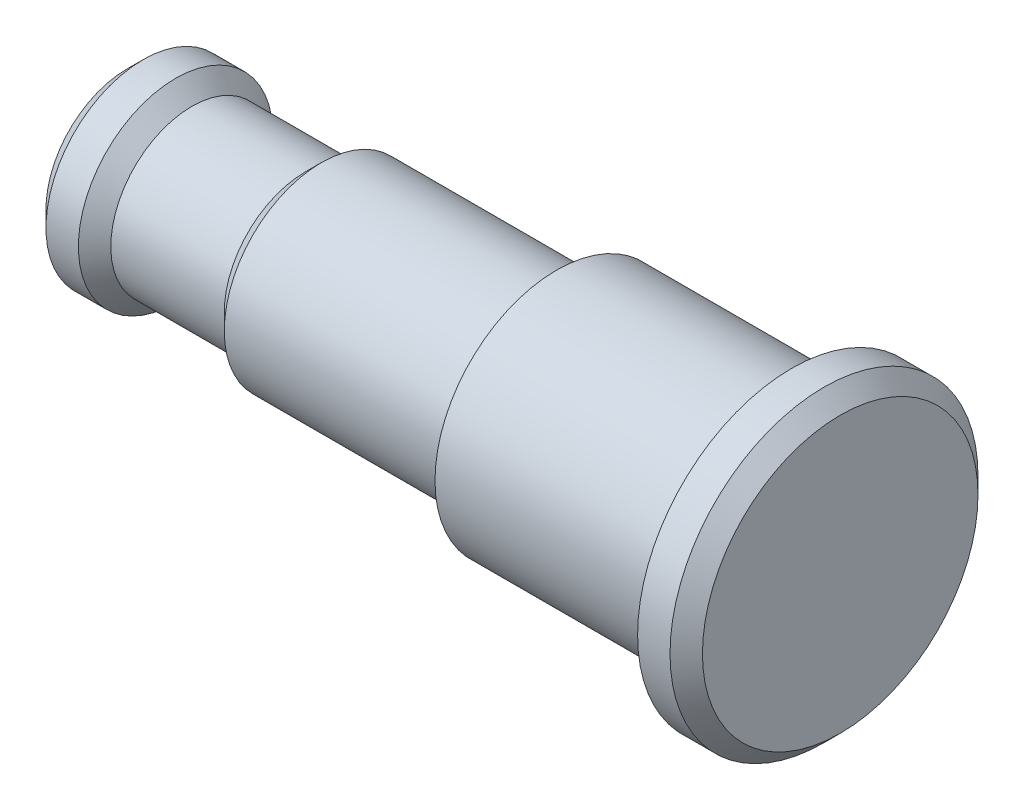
ISO-10303-21;
HEADER;
FILE_DESCRIPTION(('STEP AP214'),'2;1');
FILE_NAME('part.step','',(''),(''),'','','');
FILE_SCHEMA(('AUTOMOTIVE_DESIGN { 1 0 10303 214 1 1 1 1 }'));
ENDSEC;
DATA;
#1=APPLICATION_CONTEXT('core data for automotive mechanical design processes');
#2=APPLICATION_PROTOCOL_DEFINITION('international standard','automotive_design',2000,#1);
#3=PRODUCT_CONTEXT('',#1,'mechanical');
#4=PRODUCT('Part','Part','',(#3));
#5=PRODUCT_RELATED_PRODUCT_CATEGORY('part','',(#4));
#6=PRODUCT_DEFINITION_FORMATION('','',#4);
#7=PRODUCT_DEFINITION_CONTEXT('part definition',#1,'design');
#8=PRODUCT_DEFINITION('design','',#6,#7);
#9=PRODUCT_DEFINITION_SHAPE('','',#8);
#10=(LENGTH_UNIT() NAMED_UNIT(*) SI_UNIT(.MILLI.,.METRE.));
#11=(NAMED_UNIT(*) PLANE_ANGLE_UNIT() SI_UNIT($,.RADIAN.));
#12=(NAMED_UNIT(*) SI_UNIT($,.STERADIAN.) SOLID_ANGLE_UNIT());
#13=UNCERTAINTY_MEASURE_WITH_UNIT(LENGTH_MEASURE(1.E-05),#10,'distance_accuracy_value','');
#14=(GEOMETRIC_REPRESENTATION_CONTEXT(3) GLOBAL_UNCERTAINTY_ASSIGNED_CONTEXT((#13)) GLOBAL_UNIT_ASSIGNED_CONTEXT((#10,
#11,#12)) REPRESENTATION_CONTEXT('',''));
#15=CARTESIAN_POINT('',(0.,0.,0.));
#16=DIRECTION('',(0.,0.,1.));
#17=DIRECTION('',(1.,0.,0.));
#18=AXIS2_PLACEMENT_3D('',#15,#16,#17);
#19=CARTESIAN_POINT('',(-41.,4.75,0.));
#20=DIRECTION('',(-1.,0.,0.));
#21=DIRECTION('',(0.,-1.,0.));
#22=AXIS2_PLACEMENT_3D('',#19,#20,#21);
#23=PLANE('',#22);
#24=CARTESIAN_POINT('',(-41.0000000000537,0.,0.));
#25=DIRECTION('',(1.,0.,0.));
#26=DIRECTION('',(0.,1.,0.));
#27=AXIS2_PLACEMENT_3D('',#24,#25,#26);
#28=CIRCLE('',#27,4.99999999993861);
#29=CARTESIAN_POINT('',(-41.0000000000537,4.99999999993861,0.));
#30=VERTEX_POINT('',#29);
#31=EDGE_CURVE('E19',#30,#30,#28,.T.);
#32=ORIENTED_EDGE('',*,*,#31,.F.);
#33=EDGE_LOOP('',(#32));
#34=FACE_BOUND('',#33,.T.);
#35=ADVANCED_FACE('F15',(#34),#23,.T.);
#36=CARTESIAN_POINT('',(-40.0000000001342,0.,0.));
#37=DIRECTION('',(1.,0.,0.));
#38=DIRECTION('',(0.,1.,0.));
#39=AXIS2_PLACEMENT_3D('',#36,#37,#38);
#40=CONICAL_SURFACE('',#39,5.99999999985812,0.785398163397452);
#41=ORIENTED_EDGE('',*,*,#31,.T.);
#42=EDGE_LOOP('',(#41));
#43=FACE_BOUND('',#42,.T.);
#44=CARTESIAN_POINT('',(-40.,0.,0.));
#45=DIRECTION('',(1.,0.,0.));
#46=DIRECTION('',(0.,1.,0.));
#47=AXIS2_PLACEMENT_3D('',#44,#45,#46);
#48=CIRCLE('',#47,5.99999999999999);
#49=CARTESIAN_POINT('',(-40.,5.99999999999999,0.));
#50=VERTEX_POINT('',#49);
#51=EDGE_CURVE('E31',#50,#50,#48,.F.);
#52=ORIENTED_EDGE('',*,*,#51,.T.);
#53=EDGE_LOOP('',(#52));
#54=FACE_BOUND('',#53,.T.);
#55=ADVANCED_FACE('F65',(#43,#54),#40,.T.);
#56=CARTESIAN_POINT('',(-38.,0.,0.));
#57=DIRECTION('',(-1.,0.,0.));
#58=DIRECTION('',(0.,0.,1.));
#59=AXIS2_PLACEMENT_3D('',#56,#57,#58);
#60=CYLINDRICAL_SURFACE('',#59,5.99999999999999);
#61=CARTESIAN_POINT('',(-38.0000000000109,0.,0.));
#62=DIRECTION('',(-1.,0.,0.));
#63=DIRECTION('',(0.,1.,0.));
#64=AXIS2_PLACEMENT_3D('',#61,#62,#63);
#65=CIRCLE('',#64,5.99999999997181);
#66=CARTESIAN_POINT('',(-38.0000000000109,5.99999999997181,0.));
#67=VERTEX_POINT('',#66);
#68=EDGE_CURVE('E53',#67,#67,#65,.T.);
#69=ORIENTED_EDGE('',*,*,#68,.T.);
#70=EDGE_LOOP('',(#69));
#71=FACE_BOUND('',#70,.T.);
#72=ORIENTED_EDGE('',*,*,#51,.F.);
#73=EDGE_LOOP('',(#72));
#74=FACE_BOUND('',#73,.T.);
#75=ADVANCED_FACE('F73',(#71,#74),#60,.T.);
#76=CARTESIAN_POINT('',(-37.0000000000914,0.,0.));
#77=DIRECTION('',(-1.,0.,0.));
#78=DIRECTION('',(0.,0.,1.));
#79=AXIS2_PLACEMENT_3D('',#76,#77,#78);
#80=CONICAL_SURFACE('',#79,5.0000000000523,0.785398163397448);
#81=CARTESIAN_POINT('',(-37.,0.,0.));
#82=DIRECTION('',(1.,0.,0.));
#83=DIRECTION('',(0.,1.,0.));
#84=AXIS2_PLACEMENT_3D('',#81,#82,#83);
#85=CIRCLE('',#84,4.99999999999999);
#86=CARTESIAN_POINT('',(-37.,4.99999999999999,0.));
#87=VERTEX_POINT('',#86);
#88=EDGE_CURVE('E48',#87,#87,#85,.F.);
#89=ORIENTED_EDGE('',*,*,#88,.T.);
#90=EDGE_LOOP('',(#89));
#91=FACE_BOUND('',#90,.T.);
#92=ORIENTED_EDGE('',*,*,#68,.F.);
#93=EDGE_LOOP('',(#92));
#94=FACE_BOUND('',#93,.T.);
#95=ADVANCED_FACE('F114',(#91,#94),#80,.T.);
#96=CARTESIAN_POINT('',(-30.,0.,0.));
#97=DIRECTION('',(-1.,0.,0.));
#98=DIRECTION('',(0.,0.,1.));
#99=AXIS2_PLACEMENT_3D('',#96,#97,#98);
#100=CYLINDRICAL_SURFACE('',#99,4.99999999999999);
#101=CARTESIAN_POINT('',(-29.9999999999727,0.,0.));
#102=DIRECTION('',(1.,0.,0.));
#103=DIRECTION('',(0.,1.,0.));
#104=AXIS2_PLACEMENT_3D('',#101,#102,#103);
#105=CIRCLE('',#104,4.99999999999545);
#106=CARTESIAN_POINT('',(-29.9999999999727,4.99999999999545,0.));
#107=VERTEX_POINT('',#106);
#108=EDGE_CURVE('E42',#107,#107,#105,.F.);
#109=ORIENTED_EDGE('',*,*,#108,.T.);
#110=EDGE_LOOP('',(#109));
#111=FACE_BOUND('',#110,.T.);
#112=ORIENTED_EDGE('',*,*,#88,.F.);
#113=EDGE_LOOP('',(#112));
#114=FACE_BOUND('',#113,.T.);
#115=ADVANCED_FACE('F110',(#111,#114),#100,.T.);
#116=CARTESIAN_POINT('',(3.,4.75,0.));
#117=DIRECTION('',(1.,0.,0.));
#118=DIRECTION('',(0.,0.,-1.));
#119=AXIS2_PLACEMENT_3D('',#116,#117,#118);
#120=PLANE('',#119);
#121=CARTESIAN_POINT('',(3.,0.,0.));
#122=DIRECTION('',(-1.,0.,0.));
#123=DIRECTION('',(0.,-1.,0.));
#124=AXIS2_PLACEMENT_3D('',#121,#122,#123);
#125=CIRCLE('',#124,8.5);
#126=CARTESIAN_POINT('',(3.,-8.49999999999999,0.));
#127=VERTEX_POINT('',#126);
#128=EDGE_CURVE('E39',#127,#127,#125,.T.);
#129=ORIENTED_EDGE('',*,*,#128,.F.);
#130=EDGE_LOOP('',(#129));
#131=FACE_BOUND('',#130,.T.);
#132=ADVANCED_FACE('F106',(#131),#120,.T.);
#133=CARTESIAN_POINT('',(-29.9999999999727,0.,0.));
#134=DIRECTION('',(1.,0.,0.));
#135=DIRECTION('',(0.,0.,-1.));
#136=AXIS2_PLACEMENT_3D('',#133,#134,#135);
#137=CONICAL_SURFACE('',#136,4.99999999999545,0.785398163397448);
#138=CARTESIAN_POINT('',(-29.,0.,0.));
#139=DIRECTION('',(1.,0.,0.));
#140=DIRECTION('',(0.,1.,0.));
#141=AXIS2_PLACEMENT_3D('',#138,#139,#140);
#142=CIRCLE('',#141,5.99999999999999);
#143=CARTESIAN_POINT('',(-29.,5.99999999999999,0.));
#144=VERTEX_POINT('',#143);
#145=EDGE_CURVE('E41',#144,#144,#142,.F.);
#146=ORIENTED_EDGE('',*,*,#145,.T.);
#147=EDGE_LOOP('',(#146));
#148=FACE_BOUND('',#147,.T.);
#149=ORIENTED_EDGE('',*,*,#108,.F.);
#150=EDGE_LOOP('',(#149));
#151=FACE_BOUND('',#150,.T.);
#152=ADVANCED_FACE('F103',(#148,#151),#137,.T.);
#153=CARTESIAN_POINT('',(2.,0.,0.));
#154=DIRECTION('',(-1.,0.,0.));
#155=DIRECTION('',(0.,-1.,0.));
#156=AXIS2_PLACEMENT_3D('',#153,#154,#155);
#157=CONICAL_SURFACE('',#156,9.5,0.78539816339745);
#158=ORIENTED_EDGE('',*,*,#128,.T.);
#159=EDGE_LOOP('',(#158));
#160=FACE_BOUND('',#159,.T.);
#161=CARTESIAN_POINT('',(2.,0.,0.));
#162=DIRECTION('',(1.,0.,0.));
#163=DIRECTION('',(0.,1.,0.));
#164=AXIS2_PLACEMENT_3D('',#161,#162,#163);
#165=CIRCLE('',#164,9.5);
#166=CARTESIAN_POINT('',(1.99999999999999,9.50000000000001,0.));
#167=VERTEX_POINT('',#166);
#168=EDGE_CURVE('E38',#167,#167,#165,.F.);
#169=ORIENTED_EDGE('',*,*,#168,.F.);
#170=EDGE_LOOP('',(#169));
#171=FACE_BOUND('',#170,.T.);
#172=ADVANCED_FACE('F99',(#160,#171),#157,.T.);
#173=CARTESIAN_POINT('',(-14.5,0.,0.));
#174=DIRECTION('',(-1.,0.,0.));
#175=DIRECTION('',(0.,0.,1.));
#176=AXIS2_PLACEMENT_3D('',#173,#174,#175);
#177=CYLINDRICAL_SURFACE('',#176,5.99999999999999);
#178=CARTESIAN_POINT('',(-14.5,0.,0.));
#179=DIRECTION('',(-1.,0.,0.));
#180=DIRECTION('',(0.,0.,1.));
#181=AXIS2_PLACEMENT_3D('',#178,#179,#180);
#182=CIRCLE('',#181,5.99999999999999);
#183=CARTESIAN_POINT('',(-14.5,0.,5.99999999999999));
#184=VERTEX_POINT('',#183);
#185=EDGE_CURVE('E36',#184,#184,#182,.T.);
#186=ORIENTED_EDGE('',*,*,#185,.T.);
#187=EDGE_LOOP('',(#186));
#188=FACE_BOUND('',#187,.T.);
#189=ORIENTED_EDGE('',*,*,#145,.F.);
#190=EDGE_LOOP('',(#189));
#191=FACE_BOUND('',#190,.T.);
#192=ADVANCED_FACE('F92',(#188,#191),#177,.T.);
#193=CARTESIAN_POINT('',(-19.,0.,0.));
#194=DIRECTION('',(1.,0.,0.));
#195=DIRECTION('',(0.,1.,0.));
#196=AXIS2_PLACEMENT_3D('',#193,#194,#195);
#197=CYLINDRICAL_SURFACE('',#196,9.5);
#198=CARTESIAN_POINT('',(0.,0.,0.));
#199=DIRECTION('',(1.,0.,0.));
#200=DIRECTION('',(0.,1.,0.));
#201=AXIS2_PLACEMENT_3D('',#198,#199,#200);
#202=CIRCLE('',#201,9.5);
#203=CARTESIAN_POINT('',(0.,9.50000000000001,0.));
#204=VERTEX_POINT('',#203);
#205=EDGE_CURVE('E28',#204,#204,#202,.T.);
#206=ORIENTED_EDGE('',*,*,#205,.T.);
#207=EDGE_LOOP('',(#206));
#208=FACE_BOUND('',#207,.T.);
#209=ORIENTED_EDGE('',*,*,#168,.T.);
#210=EDGE_LOOP('',(#209));
#211=FACE_BOUND('',#210,.T.);
#212=ADVANCED_FACE('F86',(#208,#211),#197,.T.);
#213=CARTESIAN_POINT('',(-14.5,6.74999999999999,0.));
#214=DIRECTION('',(1.,0.,0.));
#215=DIRECTION('',(0.,0.,-1.));
#216=AXIS2_PLACEMENT_3D('',#213,#214,#215);
#217=PLANE('',#216);
#218=ORIENTED_EDGE('',*,*,#185,.F.);
#219=EDGE_LOOP('',(#218));
#220=FACE_BOUND('',#219,.T.);
#221=CARTESIAN_POINT('',(-14.5,0.,0.));
#222=DIRECTION('',(-1.,0.,0.));
#223=DIRECTION('',(0.,-1.,0.));
#224=AXIS2_PLACEMENT_3D('',#221,#222,#223);
#225=CIRCLE('',#224,7.5);
#226=CARTESIAN_POINT('',(-14.5,-7.5,0.));
#227=VERTEX_POINT('',#226);
#228=EDGE_CURVE('E23',#227,#227,#225,.T.);
#229=ORIENTED_EDGE('',*,*,#228,.T.);
#230=EDGE_LOOP('',(#229));
#231=FACE_BOUND('',#230,.T.);
#232=ADVANCED_FACE('F81',(#220,#231),#217,.F.);
#233=CARTESIAN_POINT('',(0.,8.5,0.));
#234=DIRECTION('',(1.,0.,0.));
#235=DIRECTION('',(0.,0.,-1.));
#236=AXIS2_PLACEMENT_3D('',#233,#234,#235);
#237=PLANE('',#236);
#238=CARTESIAN_POINT('',(0.,0.,0.));
#239=DIRECTION('',(-1.,0.,0.));
#240=DIRECTION('',(0.,-1.,0.));
#241=AXIS2_PLACEMENT_3D('',#238,#239,#240);
#242=CIRCLE('',#241,7.5);
#243=CARTESIAN_POINT('',(0.,-7.5,0.));
#244=VERTEX_POINT('',#243);
#245=EDGE_CURVE('E10',#244,#244,#242,.F.);
#246=ORIENTED_EDGE('',*,*,#245,.T.);
#247=EDGE_LOOP('',(#246));
#248=FACE_BOUND('',#247,.T.);
#249=ORIENTED_EDGE('',*,*,#205,.F.);
#250=EDGE_LOOP('',(#249));
#251=FACE_BOUND('',#250,.T.);
#252=ADVANCED_FACE('F76',(#248,#251),#237,.F.);
#253=CARTESIAN_POINT('',(0.,0.,0.));
#254=DIRECTION('',(-1.,0.,0.));
#255=DIRECTION('',(0.,-1.,0.));
#256=AXIS2_PLACEMENT_3D('',#253,#254,#255);
#257=CYLINDRICAL_SURFACE('',#256,7.5);
#258=ORIENTED_EDGE('',*,*,#245,.F.);
#259=EDGE_LOOP('',(#258));
#260=FACE_BOUND('',#259,.T.);
#261=ORIENTED_EDGE('',*,*,#228,.F.);
#262=EDGE_LOOP('',(#261));
#263=FACE_BOUND('',#262,.T.);
#264=ADVANCED_FACE('F17',(#260,#263),#257,.T.);
#265=CLOSED_SHELL('',(#35,#55,#75,#95,#115,#132,#152,#172,#192,#212,#232,#252,#264));
#266=MANIFOLD_SOLID_BREP('B1',#265);
#267=ADVANCED_BREP_SHAPE_REPRESENTATION('',(#18,#266),#14);
#268=SHAPE_DEFINITION_REPRESENTATION(#9,#267);
ENDSEC;
END-ISO-10303-21;
